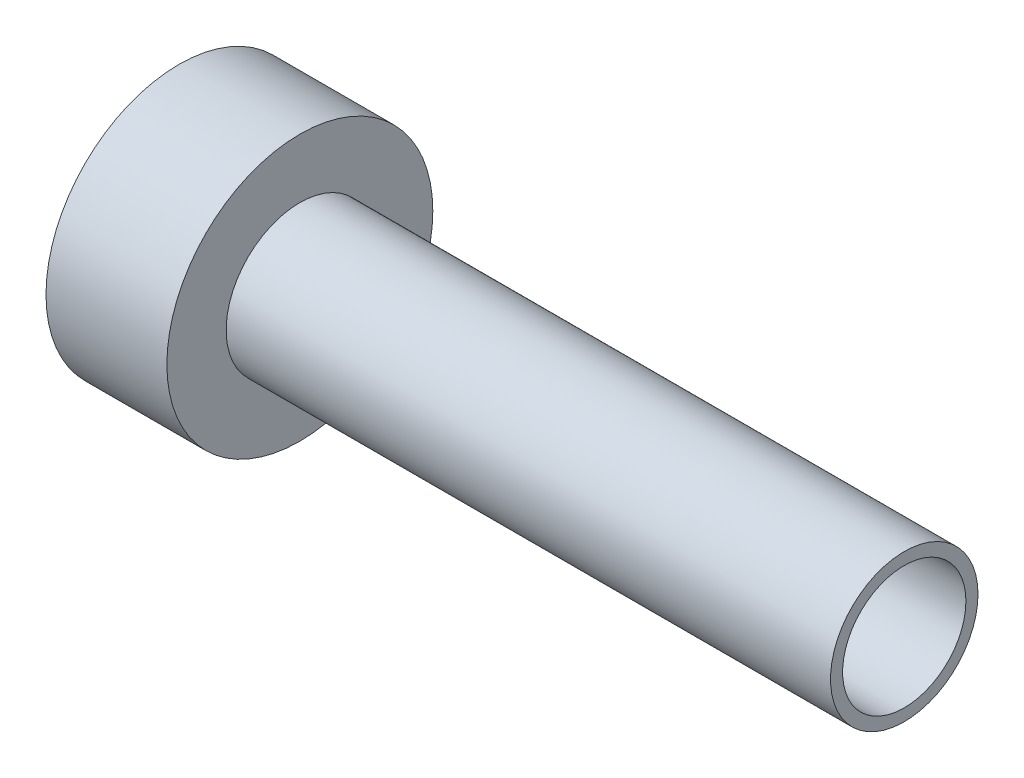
ISO-10303-21;
HEADER;
FILE_DESCRIPTION(('STEP AP214'),'2;1');
FILE_NAME('part.step','',(''),(''),'','','');
FILE_SCHEMA(('AUTOMOTIVE_DESIGN { 1 0 10303 214 1 1 1 1 }'));
ENDSEC;
DATA;
#1=APPLICATION_CONTEXT('core data for automotive mechanical design processes');
#2=APPLICATION_PROTOCOL_DEFINITION('international standard','automotive_design',2000,#1);
#3=PRODUCT_CONTEXT('',#1,'mechanical');
#4=PRODUCT('Part','Part','',(#3));
#5=PRODUCT_RELATED_PRODUCT_CATEGORY('part','',(#4));
#6=PRODUCT_DEFINITION_FORMATION('','',#4);
#7=PRODUCT_DEFINITION_CONTEXT('part definition',#1,'design');
#8=PRODUCT_DEFINITION('design','',#6,#7);
#9=PRODUCT_DEFINITION_SHAPE('','',#8);
#10=(LENGTH_UNIT() NAMED_UNIT(*) SI_UNIT(.MILLI.,.METRE.));
#11=(NAMED_UNIT(*) PLANE_ANGLE_UNIT() SI_UNIT($,.RADIAN.));
#12=(NAMED_UNIT(*) SI_UNIT($,.STERADIAN.) SOLID_ANGLE_UNIT());
#13=UNCERTAINTY_MEASURE_WITH_UNIT(LENGTH_MEASURE(1.E-05),#10,'distance_accuracy_value','');
#14=(GEOMETRIC_REPRESENTATION_CONTEXT(3) GLOBAL_UNCERTAINTY_ASSIGNED_CONTEXT((#13)) GLOBAL_UNIT_ASSIGNED_CONTEXT((#10,
#11,#12)) REPRESENTATION_CONTEXT('',''));
#15=CARTESIAN_POINT('',(0.,0.,0.));
#16=DIRECTION('',(0.,0.,1.));
#17=DIRECTION('',(1.,0.,0.));
#18=AXIS2_PLACEMENT_3D('',#15,#16,#17);
#19=CARTESIAN_POINT('',(50.,0.,0.));
#20=DIRECTION('',(1.,0.,0.));
#21=DIRECTION('',(0.,0.,-1.));
#22=AXIS2_PLACEMENT_3D('',#19,#20,#21);
#23=PLANE('',#22);
#24=CARTESIAN_POINT('',(50.,0.,0.));
#25=DIRECTION('',(1.,0.,0.));
#26=DIRECTION('',(0.,0.,-1.));
#27=AXIS2_PLACEMENT_3D('',#24,#25,#26);
#28=CIRCLE('',#27,55.);
#29=CARTESIAN_POINT('',(50.,0.,-55.));
#30=VERTEX_POINT('',#29);
#31=EDGE_CURVE('E10',#30,#30,#28,.T.);
#32=ORIENTED_EDGE('',*,*,#31,.T.);
#33=EDGE_LOOP('',(#32));
#34=FACE_BOUND('',#33,.T.);
#35=CARTESIAN_POINT('',(50.,0.,0.));
#36=DIRECTION('',(1.,0.,0.));
#37=DIRECTION('',(0.,0.,-1.));
#38=AXIS2_PLACEMENT_3D('',#35,#36,#37);
#39=CIRCLE('',#38,30.5);
#40=CARTESIAN_POINT('',(50.,0.,-30.5));
#41=VERTEX_POINT('',#40);
#42=EDGE_CURVE('E46',#41,#41,#39,.T.);
#43=ORIENTED_EDGE('',*,*,#42,.F.);
#44=EDGE_LOOP('',(#43));
#45=FACE_BOUND('',#44,.T.);
#46=ADVANCED_FACE('F30',(#34,#45),#23,.T.);
#47=CARTESIAN_POINT('',(0.,0.,0.));
#48=DIRECTION('',(1.,0.,0.));
#49=DIRECTION('',(0.,0.,-1.));
#50=AXIS2_PLACEMENT_3D('',#47,#48,#49);
#51=PLANE('',#50);
#52=CARTESIAN_POINT('',(0.,0.,0.));
#53=DIRECTION('',(1.,0.,0.));
#54=DIRECTION('',(0.,0.,-1.));
#55=AXIS2_PLACEMENT_3D('',#52,#53,#54);
#56=CIRCLE('',#55,55.);
#57=CARTESIAN_POINT('',(0.,0.,-55.));
#58=VERTEX_POINT('',#57);
#59=EDGE_CURVE('E34',#58,#58,#56,.T.);
#60=ORIENTED_EDGE('',*,*,#59,.F.);
#61=EDGE_LOOP('',(#60));
#62=FACE_BOUND('',#61,.T.);
#63=CARTESIAN_POINT('',(0.,0.,0.));
#64=DIRECTION('',(1.,0.,0.));
#65=DIRECTION('',(0.,0.,-1.));
#66=AXIS2_PLACEMENT_3D('',#63,#64,#65);
#67=CIRCLE('',#66,25.5);
#68=CARTESIAN_POINT('',(0.,0.,-25.5));
#69=VERTEX_POINT('',#68);
#70=EDGE_CURVE('E41',#69,#69,#67,.T.);
#71=ORIENTED_EDGE('',*,*,#70,.T.);
#72=EDGE_LOOP('',(#71));
#73=FACE_BOUND('',#72,.T.);
#74=ADVANCED_FACE('F71',(#62,#73),#51,.F.);
#75=CARTESIAN_POINT('',(50.,0.,0.));
#76=DIRECTION('',(-1.,0.,0.));
#77=DIRECTION('',(0.,0.,1.));
#78=AXIS2_PLACEMENT_3D('',#75,#76,#77);
#79=CYLINDRICAL_SURFACE('',#78,55.);
#80=ORIENTED_EDGE('',*,*,#31,.F.);
#81=EDGE_LOOP('',(#80));
#82=FACE_BOUND('',#81,.T.);
#83=ORIENTED_EDGE('',*,*,#59,.T.);
#84=EDGE_LOOP('',(#83));
#85=FACE_BOUND('',#84,.T.);
#86=ADVANCED_FACE('F32',(#82,#85),#79,.T.);
#87=CARTESIAN_POINT('',(50.,0.,0.));
#88=DIRECTION('',(-1.,0.,0.));
#89=DIRECTION('',(0.,0.,1.));
#90=AXIS2_PLACEMENT_3D('',#87,#88,#89);
#91=CYLINDRICAL_SURFACE('',#90,25.5);
#92=ORIENTED_EDGE('',*,*,#70,.F.);
#93=EDGE_LOOP('',(#92));
#94=FACE_BOUND('',#93,.T.);
#95=CARTESIAN_POINT('',(300.,0.,0.));
#96=DIRECTION('',(1.,0.,0.));
#97=DIRECTION('',(0.,0.,-1.));
#98=AXIS2_PLACEMENT_3D('',#95,#96,#97);
#99=CIRCLE('',#98,25.5);
#100=CARTESIAN_POINT('',(300.,0.,-25.5));
#101=VERTEX_POINT('',#100);
#102=EDGE_CURVE('E49',#101,#101,#99,.T.);
#103=ORIENTED_EDGE('',*,*,#102,.T.);
#104=EDGE_LOOP('',(#103));
#105=FACE_BOUND('',#104,.T.);
#106=ADVANCED_FACE('F55',(#94,#105),#91,.F.);
#107=CARTESIAN_POINT('',(300.,0.,0.));
#108=DIRECTION('',(1.,0.,0.));
#109=DIRECTION('',(0.,0.,-1.));
#110=AXIS2_PLACEMENT_3D('',#107,#108,#109);
#111=PLANE('',#110);
#112=CARTESIAN_POINT('',(300.,0.,0.));
#113=DIRECTION('',(1.,0.,0.));
#114=DIRECTION('',(0.,0.,-1.));
#115=AXIS2_PLACEMENT_3D('',#112,#113,#114);
#116=CIRCLE('',#115,30.5);
#117=CARTESIAN_POINT('',(300.,0.,-30.5));
#118=VERTEX_POINT('',#117);
#119=EDGE_CURVE('E45',#118,#118,#116,.T.);
#120=ORIENTED_EDGE('',*,*,#119,.T.);
#121=EDGE_LOOP('',(#120));
#122=FACE_BOUND('',#121,.T.);
#123=ORIENTED_EDGE('',*,*,#102,.F.);
#124=EDGE_LOOP('',(#123));
#125=FACE_BOUND('',#124,.T.);
#126=ADVANCED_FACE('F57',(#122,#125),#111,.T.);
#127=CARTESIAN_POINT('',(300.,0.,0.));
#128=DIRECTION('',(-1.,0.,0.));
#129=DIRECTION('',(0.,0.,1.));
#130=AXIS2_PLACEMENT_3D('',#127,#128,#129);
#131=CYLINDRICAL_SURFACE('',#130,30.5);
#132=ORIENTED_EDGE('',*,*,#119,.F.);
#133=EDGE_LOOP('',(#132));
#134=FACE_BOUND('',#133,.T.);
#135=ORIENTED_EDGE('',*,*,#42,.T.);
#136=EDGE_LOOP('',(#135));
#137=FACE_BOUND('',#136,.T.);
#138=ADVANCED_FACE('F59',(#134,#137),#131,.T.);
#139=CLOSED_SHELL('',(#46,#74,#86,#106,#126,#138));
#140=MANIFOLD_SOLID_BREP('B2',#139);
#141=ADVANCED_BREP_SHAPE_REPRESENTATION('',(#18,#140),#14);
#142=SHAPE_DEFINITION_REPRESENTATION(#9,#141);
ENDSEC;
END-ISO-10303-21;
